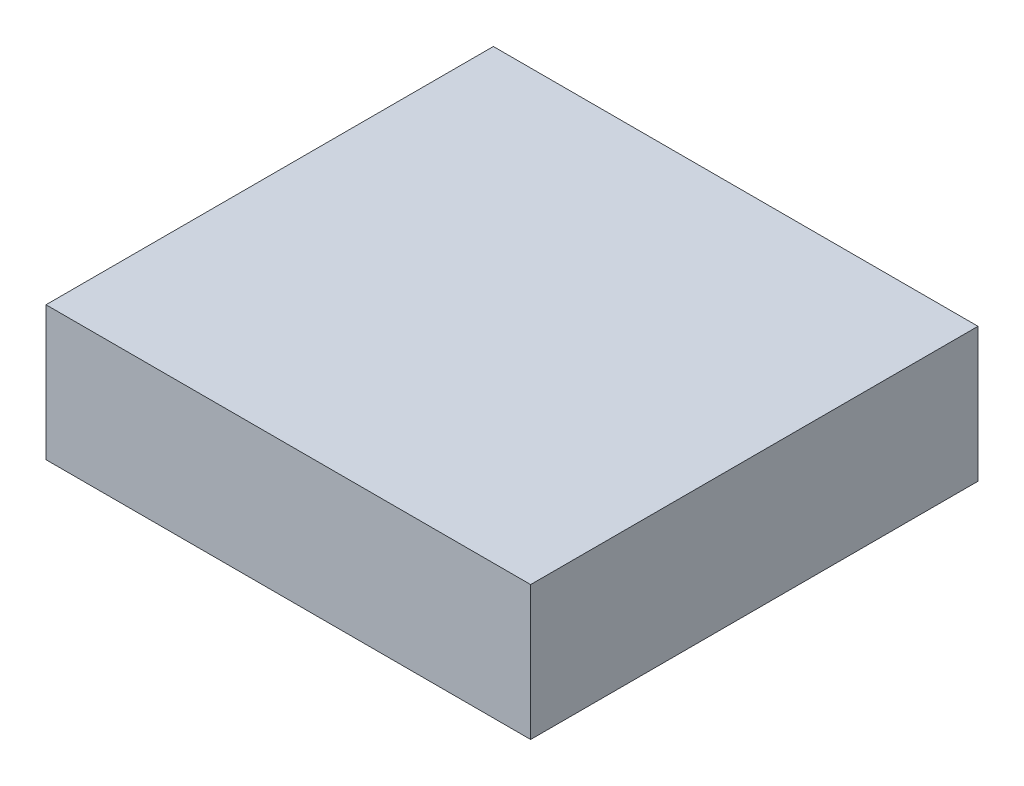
ISO-10303-21;
HEADER;
FILE_DESCRIPTION(('STEP AP214'),'2;1');
FILE_NAME('part.step','',(''),(''),'','','');
FILE_SCHEMA(('AUTOMOTIVE_DESIGN { 1 0 10303 214 1 1 1 1 }'));
ENDSEC;
DATA;
#1=APPLICATION_CONTEXT('core data for automotive mechanical design processes');
#2=APPLICATION_PROTOCOL_DEFINITION('international standard','automotive_design',2000,#1);
#3=PRODUCT_CONTEXT('',#1,'mechanical');
#4=PRODUCT('Part','Part','',(#3));
#5=PRODUCT_RELATED_PRODUCT_CATEGORY('part','',(#4));
#6=PRODUCT_DEFINITION_FORMATION('','',#4);
#7=PRODUCT_DEFINITION_CONTEXT('part definition',#1,'design');
#8=PRODUCT_DEFINITION('design','',#6,#7);
#9=PRODUCT_DEFINITION_SHAPE('','',#8);
#10=(LENGTH_UNIT() NAMED_UNIT(*) SI_UNIT(.MILLI.,.METRE.));
#11=(NAMED_UNIT(*) PLANE_ANGLE_UNIT() SI_UNIT($,.RADIAN.));
#12=(NAMED_UNIT(*) SI_UNIT($,.STERADIAN.) SOLID_ANGLE_UNIT());
#13=UNCERTAINTY_MEASURE_WITH_UNIT(LENGTH_MEASURE(1.E-05),#10,'distance_accuracy_value','');
#14=(GEOMETRIC_REPRESENTATION_CONTEXT(3) GLOBAL_UNCERTAINTY_ASSIGNED_CONTEXT((#13)) GLOBAL_UNIT_ASSIGNED_CONTEXT((#10,
#11,#12)) REPRESENTATION_CONTEXT('',''));
#15=CARTESIAN_POINT('',(0.,0.,0.));
#16=DIRECTION('',(0.,0.,1.));
#17=DIRECTION('',(1.,0.,0.));
#18=AXIS2_PLACEMENT_3D('',#15,#16,#17);
#19=CARTESIAN_POINT('',(32.5,18.,-30.));
#20=DIRECTION('',(-1.,0.,0.));
#21=DIRECTION('',(0.,0.,1.));
#22=AXIS2_PLACEMENT_3D('',#19,#20,#21);
#23=PLANE('',#22);
#24=DIRECTION('',(0.,0.,-1.));
#25=VECTOR('',#24,1.);
#26=CARTESIAN_POINT('',(32.5,0.,-30.));
#27=LINE('',#26,#25);
#28=CARTESIAN_POINT('',(32.5,0.,30.));
#29=VERTEX_POINT('',#28);
#30=CARTESIAN_POINT('',(32.5,0.,-30.));
#31=VERTEX_POINT('',#30);
#32=EDGE_CURVE('E96',#29,#31,#27,.T.);
#33=ORIENTED_EDGE('',*,*,#32,.T.);
#34=DIRECTION('',(0.,-1.,0.));
#35=VECTOR('',#34,1.);
#36=CARTESIAN_POINT('',(32.5,18.,-30.));
#37=LINE('',#36,#35);
#38=CARTESIAN_POINT('',(32.5,18.,-30.));
#39=VERTEX_POINT('',#38);
#40=EDGE_CURVE('E11',#39,#31,#37,.T.);
#41=ORIENTED_EDGE('',*,*,#40,.F.);
#42=DIRECTION('',(0.,0.,-1.));
#43=VECTOR('',#42,1.);
#44=CARTESIAN_POINT('',(32.5,18.,-30.));
#45=LINE('',#44,#43);
#46=CARTESIAN_POINT('',(32.5,18.,30.));
#47=VERTEX_POINT('',#46);
#48=EDGE_CURVE('E84',#47,#39,#45,.T.);
#49=ORIENTED_EDGE('',*,*,#48,.F.);
#50=DIRECTION('',(0.,-1.,0.));
#51=VECTOR('',#50,1.);
#52=CARTESIAN_POINT('',(32.5,18.,30.));
#53=LINE('',#52,#51);
#54=EDGE_CURVE('E92',#47,#29,#53,.T.);
#55=ORIENTED_EDGE('',*,*,#54,.T.);
#56=EDGE_LOOP('',(#33,#41,#49,#55));
#57=FACE_BOUND('',#56,.T.);
#58=ADVANCED_FACE('F33',(#57),#23,.F.);
#59=CARTESIAN_POINT('',(-32.5,18.,-30.));
#60=DIRECTION('',(0.,0.,1.));
#61=DIRECTION('',(1.,0.,0.));
#62=AXIS2_PLACEMENT_3D('',#59,#60,#61);
#63=PLANE('',#62);
#64=DIRECTION('',(-1.,0.,0.));
#65=VECTOR('',#64,1.);
#66=CARTESIAN_POINT('',(-32.5,0.,-30.));
#67=LINE('',#66,#65);
#68=CARTESIAN_POINT('',(-32.5,0.,-30.));
#69=VERTEX_POINT('',#68);
#70=EDGE_CURVE('E88',#31,#69,#67,.T.);
#71=ORIENTED_EDGE('',*,*,#70,.T.);
#72=DIRECTION('',(0.,-1.,0.));
#73=VECTOR('',#72,1.);
#74=CARTESIAN_POINT('',(-32.5,18.,-30.));
#75=LINE('',#74,#73);
#76=CARTESIAN_POINT('',(-32.5,18.,-30.));
#77=VERTEX_POINT('',#76);
#78=EDGE_CURVE('E41',#77,#69,#75,.T.);
#79=ORIENTED_EDGE('',*,*,#78,.F.);
#80=DIRECTION('',(-1.,0.,0.));
#81=VECTOR('',#80,1.);
#82=CARTESIAN_POINT('',(-32.5,18.,-30.));
#83=LINE('',#82,#81);
#84=EDGE_CURVE('E79',#39,#77,#83,.T.);
#85=ORIENTED_EDGE('',*,*,#84,.F.);
#86=ORIENTED_EDGE('',*,*,#40,.T.);
#87=EDGE_LOOP('',(#71,#79,#85,#86));
#88=FACE_BOUND('',#87,.T.);
#89=ADVANCED_FACE('F87',(#88),#63,.F.);
#90=CARTESIAN_POINT('',(-32.5,18.,-30.));
#91=DIRECTION('',(1.,0.,0.));
#92=DIRECTION('',(0.,0.,-1.));
#93=AXIS2_PLACEMENT_3D('',#90,#91,#92);
#94=PLANE('',#93);
#95=DIRECTION('',(0.,0.,1.));
#96=VECTOR('',#95,1.);
#97=CARTESIAN_POINT('',(-32.5,0.,-30.));
#98=LINE('',#97,#96);
#99=CARTESIAN_POINT('',(-32.5,0.,30.));
#100=VERTEX_POINT('',#99);
#101=EDGE_CURVE('E66',#69,#100,#98,.T.);
#102=ORIENTED_EDGE('',*,*,#101,.T.);
#103=DIRECTION('',(0.,-1.,0.));
#104=VECTOR('',#103,1.);
#105=CARTESIAN_POINT('',(-32.5,18.,30.));
#106=LINE('',#105,#104);
#107=CARTESIAN_POINT('',(-32.5,18.,30.));
#108=VERTEX_POINT('',#107);
#109=EDGE_CURVE('E89',#108,#100,#106,.T.);
#110=ORIENTED_EDGE('',*,*,#109,.F.);
#111=DIRECTION('',(0.,0.,1.));
#112=VECTOR('',#111,1.);
#113=CARTESIAN_POINT('',(-32.5,18.,-30.));
#114=LINE('',#113,#112);
#115=EDGE_CURVE('E82',#77,#108,#114,.T.);
#116=ORIENTED_EDGE('',*,*,#115,.F.);
#117=ORIENTED_EDGE('',*,*,#78,.T.);
#118=EDGE_LOOP('',(#102,#110,#116,#117));
#119=FACE_BOUND('',#118,.T.);
#120=ADVANCED_FACE('F90',(#119),#94,.F.);
#121=CARTESIAN_POINT('',(-32.5,18.,30.));
#122=DIRECTION('',(0.,0.,-1.));
#123=DIRECTION('',(-1.,0.,0.));
#124=AXIS2_PLACEMENT_3D('',#121,#122,#123);
#125=PLANE('',#124);
#126=DIRECTION('',(1.,0.,0.));
#127=VECTOR('',#126,1.);
#128=CARTESIAN_POINT('',(-32.5,0.,30.));
#129=LINE('',#128,#127);
#130=EDGE_CURVE('E72',#100,#29,#129,.T.);
#131=ORIENTED_EDGE('',*,*,#130,.T.);
#132=ORIENTED_EDGE('',*,*,#54,.F.);
#133=DIRECTION('',(1.,0.,0.));
#134=VECTOR('',#133,1.);
#135=CARTESIAN_POINT('',(-32.5,18.,30.));
#136=LINE('',#135,#134);
#137=EDGE_CURVE('E49',#108,#47,#136,.T.);
#138=ORIENTED_EDGE('',*,*,#137,.F.);
#139=ORIENTED_EDGE('',*,*,#109,.T.);
#140=EDGE_LOOP('',(#131,#132,#138,#139));
#141=FACE_BOUND('',#140,.T.);
#142=ADVANCED_FACE('F103',(#141),#125,.F.);
#143=CARTESIAN_POINT('',(0.,18.,0.));
#144=DIRECTION('',(0.,1.,0.));
#145=DIRECTION('',(0.,0.,1.));
#146=AXIS2_PLACEMENT_3D('',#143,#144,#145);
#147=PLANE('',#146);
#148=ORIENTED_EDGE('',*,*,#48,.T.);
#149=ORIENTED_EDGE('',*,*,#84,.T.);
#150=ORIENTED_EDGE('',*,*,#115,.T.);
#151=ORIENTED_EDGE('',*,*,#137,.T.);
#152=EDGE_LOOP('',(#148,#149,#150,#151));
#153=FACE_BOUND('',#152,.T.);
#154=ADVANCED_FACE('F80',(#153),#147,.T.);
#155=CARTESIAN_POINT('',(0.,0.,0.));
#156=DIRECTION('',(0.,1.,0.));
#157=DIRECTION('',(0.,0.,1.));
#158=AXIS2_PLACEMENT_3D('',#155,#156,#157);
#159=PLANE('',#158);
#160=ORIENTED_EDGE('',*,*,#32,.F.);
#161=ORIENTED_EDGE('',*,*,#130,.F.);
#162=ORIENTED_EDGE('',*,*,#101,.F.);
#163=ORIENTED_EDGE('',*,*,#70,.F.);
#164=EDGE_LOOP('',(#160,#161,#162,#163));
#165=FACE_BOUND('',#164,.T.);
#166=ADVANCED_FACE('F106',(#165),#159,.F.);
#167=CLOSED_SHELL('',(#58,#89,#120,#142,#154,#166));
#168=MANIFOLD_SOLID_BREP('B2',#167);
#169=ADVANCED_BREP_SHAPE_REPRESENTATION('',(#18,#168),#14);
#170=SHAPE_DEFINITION_REPRESENTATION(#9,#169);
ENDSEC;
END-ISO-10303-21;
